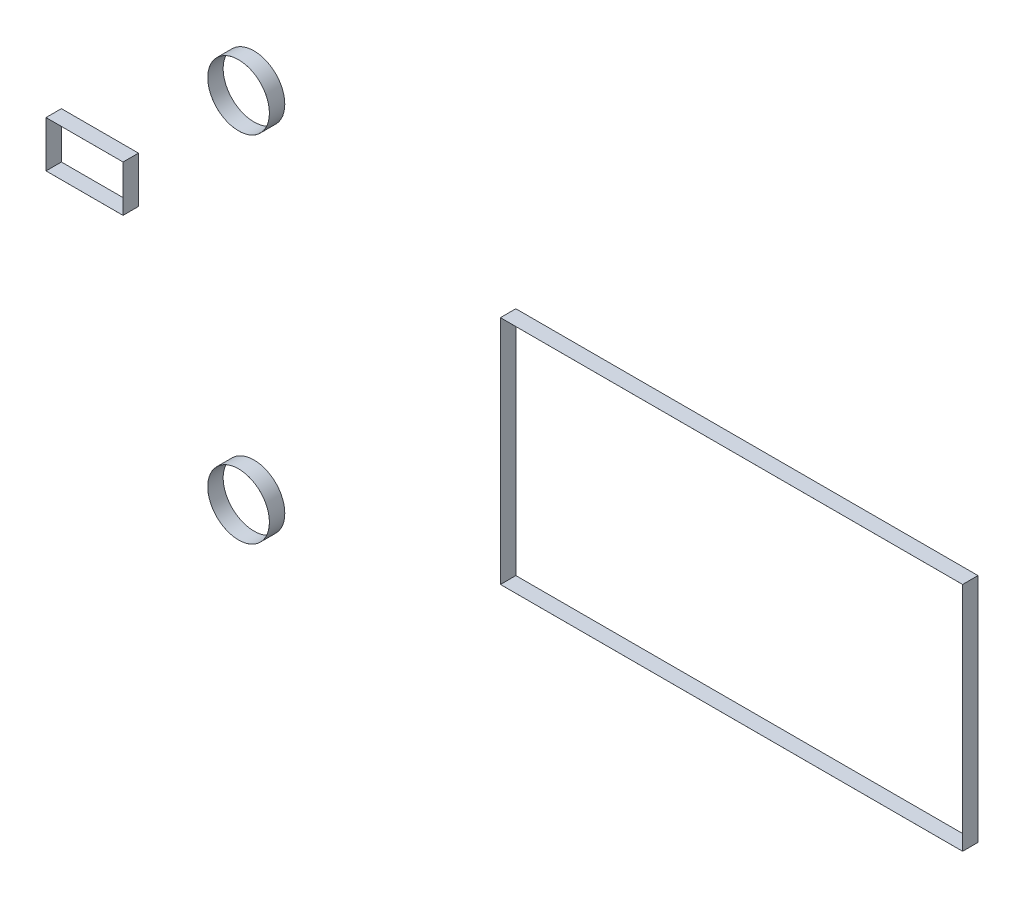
ISO-10303-21;
HEADER;
FILE_DESCRIPTION(('STEP AP214'),'2;1');
FILE_NAME('part.step','',(''),(''),'','','');
FILE_SCHEMA(('AUTOMOTIVE_DESIGN { 1 0 10303 214 1 1 1 1 }'));
ENDSEC;
DATA;
#1=APPLICATION_CONTEXT('core data for automotive mechanical design processes');
#2=APPLICATION_PROTOCOL_DEFINITION('international standard','automotive_design',2000,#1);
#3=PRODUCT_CONTEXT('',#1,'mechanical');
#4=PRODUCT('Part','Part','',(#3));
#5=PRODUCT_RELATED_PRODUCT_CATEGORY('part','',(#4));
#6=PRODUCT_DEFINITION_FORMATION('','',#4);
#7=PRODUCT_DEFINITION_CONTEXT('part definition',#1,'design');
#8=PRODUCT_DEFINITION('design','',#6,#7);
#9=PRODUCT_DEFINITION_SHAPE('','',#8);
#10=(LENGTH_UNIT() NAMED_UNIT(*) SI_UNIT(.MILLI.,.METRE.));
#11=(NAMED_UNIT(*) PLANE_ANGLE_UNIT() SI_UNIT($,.RADIAN.));
#12=(NAMED_UNIT(*) SI_UNIT($,.STERADIAN.) SOLID_ANGLE_UNIT());
#13=UNCERTAINTY_MEASURE_WITH_UNIT(LENGTH_MEASURE(1.E-05),#10,'distance_accuracy_value','');
#14=(GEOMETRIC_REPRESENTATION_CONTEXT(3) GLOBAL_UNCERTAINTY_ASSIGNED_CONTEXT((#13)) GLOBAL_UNIT_ASSIGNED_CONTEXT((#10,
#11,#12)) REPRESENTATION_CONTEXT('',''));
#15=CARTESIAN_POINT('',(0.,0.,0.));
#16=DIRECTION('',(0.,0.,1.));
#17=DIRECTION('',(1.,0.,0.));
#18=AXIS2_PLACEMENT_3D('',#15,#16,#17);
#19=CARTESIAN_POINT('',(-17.,-4.,1.));
#20=DIRECTION('',(0.,0.,1.));
#21=DIRECTION('',(1.,0.,0.));
#22=AXIS2_PLACEMENT_3D('',#19,#20,#21);
#23=PLANE('',#22);
#24=CARTESIAN_POINT('',(-17.,-4.,1.));
#25=DIRECTION('',(0.,0.,1.));
#26=DIRECTION('',(1.,0.,0.));
#27=AXIS2_PLACEMENT_3D('',#24,#25,#26);
#28=CIRCLE('',#27,2.001);
#29=CARTESIAN_POINT('',(-14.999,-4.,1.));
#30=VERTEX_POINT('',#29);
#31=EDGE_CURVE('E12',#30,#30,#28,.T.);
#32=ORIENTED_EDGE('',*,*,#31,.T.);
#33=EDGE_LOOP('',(#32));
#34=FACE_BOUND('',#33,.T.);
#35=CARTESIAN_POINT('',(-17.,-4.,1.));
#36=DIRECTION('',(0.,0.,1.));
#37=DIRECTION('',(1.,0.,0.));
#38=AXIS2_PLACEMENT_3D('',#35,#36,#37);
#39=CIRCLE('',#38,2.);
#40=CARTESIAN_POINT('',(-15.,-4.,1.));
#41=VERTEX_POINT('',#40);
#42=EDGE_CURVE('E117',#41,#41,#39,.T.);
#43=ORIENTED_EDGE('',*,*,#42,.F.);
#44=EDGE_LOOP('',(#43));
#45=FACE_BOUND('',#44,.T.);
#46=ADVANCED_FACE('F106',(#34,#45),#23,.T.);
#47=CARTESIAN_POINT('',(-17.,-4.,0.));
#48=DIRECTION('',(0.,0.,1.));
#49=DIRECTION('',(1.,0.,0.));
#50=AXIS2_PLACEMENT_3D('',#47,#48,#49);
#51=PLANE('',#50);
#52=CARTESIAN_POINT('',(-17.,-4.,0.));
#53=DIRECTION('',(0.,0.,1.));
#54=DIRECTION('',(1.,0.,0.));
#55=AXIS2_PLACEMENT_3D('',#52,#53,#54);
#56=CIRCLE('',#55,2.001);
#57=CARTESIAN_POINT('',(-14.999,-4.,0.));
#58=VERTEX_POINT('',#57);
#59=EDGE_CURVE('E110',#58,#58,#56,.T.);
#60=ORIENTED_EDGE('',*,*,#59,.F.);
#61=EDGE_LOOP('',(#60));
#62=FACE_BOUND('',#61,.T.);
#63=CARTESIAN_POINT('',(-17.,-4.,0.));
#64=DIRECTION('',(0.,0.,1.));
#65=DIRECTION('',(1.,0.,0.));
#66=AXIS2_PLACEMENT_3D('',#63,#64,#65);
#67=CIRCLE('',#66,2.);
#68=CARTESIAN_POINT('',(-15.,-4.,0.));
#69=VERTEX_POINT('',#68);
#70=EDGE_CURVE('E119',#69,#69,#67,.T.);
#71=ORIENTED_EDGE('',*,*,#70,.T.);
#72=EDGE_LOOP('',(#71));
#73=FACE_BOUND('',#72,.T.);
#74=ADVANCED_FACE('F129',(#62,#73),#51,.F.);
#75=CARTESIAN_POINT('',(-17.,-4.,1.));
#76=DIRECTION('',(0.,0.,-1.));
#77=DIRECTION('',(-1.,0.,0.));
#78=AXIS2_PLACEMENT_3D('',#75,#76,#77);
#79=CYLINDRICAL_SURFACE('',#78,2.001);
#80=ORIENTED_EDGE('',*,*,#31,.F.);
#81=EDGE_LOOP('',(#80));
#82=FACE_BOUND('',#81,.T.);
#83=ORIENTED_EDGE('',*,*,#59,.T.);
#84=EDGE_LOOP('',(#83));
#85=FACE_BOUND('',#84,.T.);
#86=ADVANCED_FACE('F108',(#82,#85),#79,.T.);
#87=CARTESIAN_POINT('',(-17.,-4.,1.));
#88=DIRECTION('',(0.,0.,-1.));
#89=DIRECTION('',(-1.,0.,0.));
#90=AXIS2_PLACEMENT_3D('',#87,#88,#89);
#91=CYLINDRICAL_SURFACE('',#90,2.);
#92=ORIENTED_EDGE('',*,*,#42,.T.);
#93=EDGE_LOOP('',(#92));
#94=FACE_BOUND('',#93,.T.);
#95=ORIENTED_EDGE('',*,*,#70,.F.);
#96=EDGE_LOOP('',(#95));
#97=FACE_BOUND('',#96,.T.);
#98=ADVANCED_FACE('F125',(#94,#97),#91,.F.);
#99=CLOSED_SHELL('',(#46,#74,#86,#98));
#100=MANIFOLD_SOLID_BREP('B2',#99);
#101=CARTESIAN_POINT('',(-17.,19.,1.));
#102=DIRECTION('',(0.,0.,1.));
#103=DIRECTION('',(1.,0.,0.));
#104=AXIS2_PLACEMENT_3D('',#101,#102,#103);
#105=PLANE('',#104);
#106=CARTESIAN_POINT('',(-17.,19.,1.));
#107=DIRECTION('',(0.,0.,1.));
#108=DIRECTION('',(1.,0.,0.));
#109=AXIS2_PLACEMENT_3D('',#106,#107,#108);
#110=CIRCLE('',#109,2.001);
#111=CARTESIAN_POINT('',(-14.999,19.,1.));
#112=VERTEX_POINT('',#111);
#113=EDGE_CURVE('E105',#112,#112,#110,.T.);
#114=ORIENTED_EDGE('',*,*,#113,.T.);
#115=EDGE_LOOP('',(#114));
#116=FACE_BOUND('',#115,.T.);
#117=CARTESIAN_POINT('',(-17.,19.,1.));
#118=DIRECTION('',(0.,0.,1.));
#119=DIRECTION('',(1.,0.,0.));
#120=AXIS2_PLACEMENT_3D('',#117,#118,#119);
#121=CIRCLE('',#120,2.);
#122=CARTESIAN_POINT('',(-15.,19.,1.));
#123=VERTEX_POINT('',#122);
#124=EDGE_CURVE('E205',#123,#123,#121,.T.);
#125=ORIENTED_EDGE('',*,*,#124,.F.);
#126=EDGE_LOOP('',(#125));
#127=FACE_BOUND('',#126,.T.);
#128=ADVANCED_FACE('F194',(#116,#127),#105,.T.);
#129=CARTESIAN_POINT('',(-17.,19.,0.));
#130=DIRECTION('',(0.,0.,1.));
#131=DIRECTION('',(1.,0.,0.));
#132=AXIS2_PLACEMENT_3D('',#129,#130,#131);
#133=PLANE('',#132);
#134=CARTESIAN_POINT('',(-17.,19.,0.));
#135=DIRECTION('',(0.,0.,1.));
#136=DIRECTION('',(1.,0.,0.));
#137=AXIS2_PLACEMENT_3D('',#134,#135,#136);
#138=CIRCLE('',#137,2.001);
#139=CARTESIAN_POINT('',(-14.999,19.,0.));
#140=VERTEX_POINT('',#139);
#141=EDGE_CURVE('E198',#140,#140,#138,.T.);
#142=ORIENTED_EDGE('',*,*,#141,.F.);
#143=EDGE_LOOP('',(#142));
#144=FACE_BOUND('',#143,.T.);
#145=CARTESIAN_POINT('',(-17.,19.,0.));
#146=DIRECTION('',(0.,0.,1.));
#147=DIRECTION('',(1.,0.,0.));
#148=AXIS2_PLACEMENT_3D('',#145,#146,#147);
#149=CIRCLE('',#148,2.);
#150=CARTESIAN_POINT('',(-15.,19.,0.));
#151=VERTEX_POINT('',#150);
#152=EDGE_CURVE('E207',#151,#151,#149,.T.);
#153=ORIENTED_EDGE('',*,*,#152,.T.);
#154=EDGE_LOOP('',(#153));
#155=FACE_BOUND('',#154,.T.);
#156=ADVANCED_FACE('F217',(#144,#155),#133,.F.);
#157=CARTESIAN_POINT('',(-17.,19.,1.));
#158=DIRECTION('',(0.,0.,-1.));
#159=DIRECTION('',(-1.,0.,0.));
#160=AXIS2_PLACEMENT_3D('',#157,#158,#159);
#161=CYLINDRICAL_SURFACE('',#160,2.001);
#162=ORIENTED_EDGE('',*,*,#113,.F.);
#163=EDGE_LOOP('',(#162));
#164=FACE_BOUND('',#163,.T.);
#165=ORIENTED_EDGE('',*,*,#141,.T.);
#166=EDGE_LOOP('',(#165));
#167=FACE_BOUND('',#166,.T.);
#168=ADVANCED_FACE('F196',(#164,#167),#161,.T.);
#169=CARTESIAN_POINT('',(-17.,19.,1.));
#170=DIRECTION('',(0.,0.,-1.));
#171=DIRECTION('',(-1.,0.,0.));
#172=AXIS2_PLACEMENT_3D('',#169,#170,#171);
#173=CYLINDRICAL_SURFACE('',#172,2.);
#174=ORIENTED_EDGE('',*,*,#124,.T.);
#175=EDGE_LOOP('',(#174));
#176=FACE_BOUND('',#175,.T.);
#177=ORIENTED_EDGE('',*,*,#152,.F.);
#178=EDGE_LOOP('',(#177));
#179=FACE_BOUND('',#178,.T.);
#180=ADVANCED_FACE('F213',(#176,#179),#173,.F.);
#181=CLOSED_SHELL('',(#128,#156,#168,#180));
#182=MANIFOLD_SOLID_BREP('B7',#181);
#183=CARTESIAN_POINT('',(0.,0.,1.));
#184=DIRECTION('',(0.,0.,1.));
#185=DIRECTION('',(1.,0.,0.));
#186=AXIS2_PLACEMENT_3D('',#183,#184,#185);
#187=PLANE('',#186);
#188=DIRECTION('',(0.,-1.,0.));
#189=VECTOR('',#188,1.);
#190=CARTESIAN_POINT('',(-29.501,11.5,1.));
#191=LINE('',#190,#189);
#192=CARTESIAN_POINT('',(-29.501,11.501,1.));
#193=VERTEX_POINT('',#192);
#194=CARTESIAN_POINT('',(-29.501,8.499,1.));
#195=VERTEX_POINT('',#194);
#196=EDGE_CURVE('E382',#193,#195,#191,.T.);
#197=ORIENTED_EDGE('',*,*,#196,.T.);
#198=DIRECTION('',(1.,0.,0.));
#199=VECTOR('',#198,1.);
#200=CARTESIAN_POINT('',(-29.5,8.499,1.));
#201=LINE('',#200,#199);
#202=CARTESIAN_POINT('',(-24.499,8.499,1.));
#203=VERTEX_POINT('',#202);
#204=EDGE_CURVE('E385',#195,#203,#201,.T.);
#205=ORIENTED_EDGE('',*,*,#204,.T.);
#206=DIRECTION('',(0.,1.,0.));
#207=VECTOR('',#206,1.);
#208=CARTESIAN_POINT('',(-24.499,11.5,1.));
#209=LINE('',#208,#207);
#210=CARTESIAN_POINT('',(-24.499,11.501,1.));
#211=VERTEX_POINT('',#210);
#212=EDGE_CURVE('E388',#203,#211,#209,.T.);
#213=ORIENTED_EDGE('',*,*,#212,.T.);
#214=DIRECTION('',(-1.,0.,0.));
#215=VECTOR('',#214,1.);
#216=CARTESIAN_POINT('',(-29.5,11.501,1.));
#217=LINE('',#216,#215);
#218=EDGE_CURVE('E390',#211,#193,#217,.T.);
#219=ORIENTED_EDGE('',*,*,#218,.T.);
#220=EDGE_LOOP('',(#197,#205,#213,#219));
#221=FACE_BOUND('',#220,.T.);
#222=DIRECTION('',(1.,0.,0.));
#223=VECTOR('',#222,1.);
#224=CARTESIAN_POINT('',(-29.5,8.5,1.));
#225=LINE('',#224,#223);
#226=CARTESIAN_POINT('',(-29.5,8.5,1.));
#227=VERTEX_POINT('',#226);
#228=CARTESIAN_POINT('',(-24.5,8.5,1.));
#229=VERTEX_POINT('',#228);
#230=EDGE_CURVE('E354',#227,#229,#225,.T.);
#231=ORIENTED_EDGE('',*,*,#230,.F.);
#232=DIRECTION('',(0.,-1.,0.));
#233=VECTOR('',#232,1.);
#234=CARTESIAN_POINT('',(-29.5,11.5,1.));
#235=LINE('',#234,#233);
#236=CARTESIAN_POINT('',(-29.5,11.5,1.));
#237=VERTEX_POINT('',#236);
#238=EDGE_CURVE('E346',#237,#227,#235,.T.);
#239=ORIENTED_EDGE('',*,*,#238,.F.);
#240=DIRECTION('',(-1.,0.,0.));
#241=VECTOR('',#240,1.);
#242=CARTESIAN_POINT('',(-29.5,11.5,1.));
#243=LINE('',#242,#241);
#244=CARTESIAN_POINT('',(-24.5,11.5,1.));
#245=VERTEX_POINT('',#244);
#246=EDGE_CURVE('E368',#245,#237,#243,.T.);
#247=ORIENTED_EDGE('',*,*,#246,.F.);
#248=DIRECTION('',(0.,1.,0.));
#249=VECTOR('',#248,1.);
#250=CARTESIAN_POINT('',(-24.5,11.5,1.));
#251=LINE('',#250,#249);
#252=EDGE_CURVE('E366',#229,#245,#251,.T.);
#253=ORIENTED_EDGE('',*,*,#252,.F.);
#254=EDGE_LOOP('',(#231,#239,#247,#253));
#255=FACE_BOUND('',#254,.T.);
#256=ADVANCED_FACE('F281',(#221,#255),#187,.T.);
#257=CARTESIAN_POINT('',(0.,0.,0.));
#258=DIRECTION('',(0.,0.,1.));
#259=DIRECTION('',(1.,0.,0.));
#260=AXIS2_PLACEMENT_3D('',#257,#258,#259);
#261=PLANE('',#260);
#262=DIRECTION('',(0.,-1.,0.));
#263=VECTOR('',#262,1.);
#264=CARTESIAN_POINT('',(-29.501,11.5,0.));
#265=LINE('',#264,#263);
#266=CARTESIAN_POINT('',(-29.501,11.501,0.));
#267=VERTEX_POINT('',#266);
#268=CARTESIAN_POINT('',(-29.501,8.499,0.));
#269=VERTEX_POINT('',#268);
#270=EDGE_CURVE('E362',#267,#269,#265,.T.);
#271=ORIENTED_EDGE('',*,*,#270,.F.);
#272=DIRECTION('',(-1.,0.,0.));
#273=VECTOR('',#272,1.);
#274=CARTESIAN_POINT('',(-29.5,11.501,0.));
#275=LINE('',#274,#273);
#276=CARTESIAN_POINT('',(-24.499,11.501,0.));
#277=VERTEX_POINT('',#276);
#278=EDGE_CURVE('E386',#277,#267,#275,.T.);
#279=ORIENTED_EDGE('',*,*,#278,.F.);
#280=DIRECTION('',(0.,1.,0.));
#281=VECTOR('',#280,1.);
#282=CARTESIAN_POINT('',(-24.499,11.5,0.));
#283=LINE('',#282,#281);
#284=CARTESIAN_POINT('',(-24.499,8.499,0.));
#285=VERTEX_POINT('',#284);
#286=EDGE_CURVE('E397',#285,#277,#283,.T.);
#287=ORIENTED_EDGE('',*,*,#286,.F.);
#288=DIRECTION('',(1.,0.,0.));
#289=VECTOR('',#288,1.);
#290=CARTESIAN_POINT('',(-29.5,8.499,0.));
#291=LINE('',#290,#289);
#292=EDGE_CURVE('E395',#269,#285,#291,.T.);
#293=ORIENTED_EDGE('',*,*,#292,.F.);
#294=EDGE_LOOP('',(#271,#279,#287,#293));
#295=FACE_BOUND('',#294,.T.);
#296=DIRECTION('',(0.,-1.,0.));
#297=VECTOR('',#296,1.);
#298=CARTESIAN_POINT('',(-29.5,11.5,0.));
#299=LINE('',#298,#297);
#300=CARTESIAN_POINT('',(-29.5,11.5,0.));
#301=VERTEX_POINT('',#300);
#302=CARTESIAN_POINT('',(-29.5,8.5,0.));
#303=VERTEX_POINT('',#302);
#304=EDGE_CURVE('E304',#301,#303,#299,.T.);
#305=ORIENTED_EDGE('',*,*,#304,.T.);
#306=DIRECTION('',(1.,0.,0.));
#307=VECTOR('',#306,1.);
#308=CARTESIAN_POINT('',(-29.5,8.5,0.));
#309=LINE('',#308,#307);
#310=CARTESIAN_POINT('',(-24.5,8.5,0.));
#311=VERTEX_POINT('',#310);
#312=EDGE_CURVE('E361',#303,#311,#309,.T.);
#313=ORIENTED_EDGE('',*,*,#312,.T.);
#314=DIRECTION('',(0.,1.,0.));
#315=VECTOR('',#314,1.);
#316=CARTESIAN_POINT('',(-24.5,11.5,0.));
#317=LINE('',#316,#315);
#318=CARTESIAN_POINT('',(-24.5,11.5,0.));
#319=VERTEX_POINT('',#318);
#320=EDGE_CURVE('E374',#311,#319,#317,.T.);
#321=ORIENTED_EDGE('',*,*,#320,.T.);
#322=DIRECTION('',(-1.,0.,0.));
#323=VECTOR('',#322,1.);
#324=CARTESIAN_POINT('',(-29.5,11.5,0.));
#325=LINE('',#324,#323);
#326=EDGE_CURVE('E355',#319,#301,#325,.T.);
#327=ORIENTED_EDGE('',*,*,#326,.T.);
#328=EDGE_LOOP('',(#305,#313,#321,#327));
#329=FACE_BOUND('',#328,.T.);
#330=ADVANCED_FACE('F415',(#295,#329),#261,.F.);
#331=CARTESIAN_POINT('',(-29.501,11.5,1.));
#332=DIRECTION('',(1.,0.,0.));
#333=DIRECTION('',(0.,0.,-1.));
#334=AXIS2_PLACEMENT_3D('',#331,#332,#333);
#335=PLANE('',#334);
#336=ORIENTED_EDGE('',*,*,#270,.T.);
#337=DIRECTION('',(0.,0.,-1.));
#338=VECTOR('',#337,1.);
#339=CARTESIAN_POINT('',(-29.501,8.499,1.));
#340=LINE('',#339,#338);
#341=EDGE_CURVE('E192',#195,#269,#340,.T.);
#342=ORIENTED_EDGE('',*,*,#341,.F.);
#343=ORIENTED_EDGE('',*,*,#196,.F.);
#344=DIRECTION('',(0.,0.,-1.));
#345=VECTOR('',#344,1.);
#346=CARTESIAN_POINT('',(-29.501,11.501,1.));
#347=LINE('',#346,#345);
#348=EDGE_CURVE('E392',#193,#267,#347,.T.);
#349=ORIENTED_EDGE('',*,*,#348,.T.);
#350=EDGE_LOOP('',(#336,#342,#343,#349));
#351=FACE_BOUND('',#350,.T.);
#352=ADVANCED_FACE('F283',(#351),#335,.F.);
#353=CARTESIAN_POINT('',(-29.5,8.499,1.));
#354=DIRECTION('',(0.,1.,0.));
#355=DIRECTION('',(0.,0.,1.));
#356=AXIS2_PLACEMENT_3D('',#353,#354,#355);
#357=PLANE('',#356);
#358=ORIENTED_EDGE('',*,*,#292,.T.);
#359=DIRECTION('',(0.,0.,-1.));
#360=VECTOR('',#359,1.);
#361=CARTESIAN_POINT('',(-24.499,8.499,1.));
#362=LINE('',#361,#360);
#363=EDGE_CURVE('E289',#203,#285,#362,.T.);
#364=ORIENTED_EDGE('',*,*,#363,.F.);
#365=ORIENTED_EDGE('',*,*,#204,.F.);
#366=ORIENTED_EDGE('',*,*,#341,.T.);
#367=EDGE_LOOP('',(#358,#364,#365,#366));
#368=FACE_BOUND('',#367,.T.);
#369=ADVANCED_FACE('F425',(#368),#357,.F.);
#370=CARTESIAN_POINT('',(-24.499,11.5,1.));
#371=DIRECTION('',(-1.,0.,0.));
#372=DIRECTION('',(0.,0.,1.));
#373=AXIS2_PLACEMENT_3D('',#370,#371,#372);
#374=PLANE('',#373);
#375=ORIENTED_EDGE('',*,*,#286,.T.);
#376=DIRECTION('',(0.,0.,-1.));
#377=VECTOR('',#376,1.);
#378=CARTESIAN_POINT('',(-24.499,11.501,1.));
#379=LINE('',#378,#377);
#380=EDGE_CURVE('E402',#211,#277,#379,.T.);
#381=ORIENTED_EDGE('',*,*,#380,.F.);
#382=ORIENTED_EDGE('',*,*,#212,.F.);
#383=ORIENTED_EDGE('',*,*,#363,.T.);
#384=EDGE_LOOP('',(#375,#381,#382,#383));
#385=FACE_BOUND('',#384,.T.);
#386=ADVANCED_FACE('F409',(#385),#374,.F.);
#387=CARTESIAN_POINT('',(-29.5,11.501,1.));
#388=DIRECTION('',(0.,-1.,0.));
#389=DIRECTION('',(0.,0.,-1.));
#390=AXIS2_PLACEMENT_3D('',#387,#388,#389);
#391=PLANE('',#390);
#392=ORIENTED_EDGE('',*,*,#278,.T.);
#393=ORIENTED_EDGE('',*,*,#348,.F.);
#394=ORIENTED_EDGE('',*,*,#218,.F.);
#395=ORIENTED_EDGE('',*,*,#380,.T.);
#396=EDGE_LOOP('',(#392,#393,#394,#395));
#397=FACE_BOUND('',#396,.T.);
#398=ADVANCED_FACE('F419',(#397),#391,.F.);
#399=CARTESIAN_POINT('',(-29.5,11.5,1.));
#400=DIRECTION('',(1.,0.,0.));
#401=DIRECTION('',(0.,0.,-1.));
#402=AXIS2_PLACEMENT_3D('',#399,#400,#401);
#403=PLANE('',#402);
#404=ORIENTED_EDGE('',*,*,#304,.F.);
#405=DIRECTION('',(0.,0.,-1.));
#406=VECTOR('',#405,1.);
#407=CARTESIAN_POINT('',(-29.5,11.5,1.));
#408=LINE('',#407,#406);
#409=EDGE_CURVE('E350',#237,#301,#408,.T.);
#410=ORIENTED_EDGE('',*,*,#409,.F.);
#411=ORIENTED_EDGE('',*,*,#238,.T.);
#412=DIRECTION('',(0.,0.,-1.));
#413=VECTOR('',#412,1.);
#414=CARTESIAN_POINT('',(-29.5,8.5,1.));
#415=LINE('',#414,#413);
#416=EDGE_CURVE('E349',#227,#303,#415,.T.);
#417=ORIENTED_EDGE('',*,*,#416,.T.);
#418=EDGE_LOOP('',(#404,#410,#411,#417));
#419=FACE_BOUND('',#418,.T.);
#420=ADVANCED_FACE('F348',(#419),#403,.T.);
#421=CARTESIAN_POINT('',(-29.5,8.5,1.));
#422=DIRECTION('',(0.,1.,0.));
#423=DIRECTION('',(0.,0.,1.));
#424=AXIS2_PLACEMENT_3D('',#421,#422,#423);
#425=PLANE('',#424);
#426=ORIENTED_EDGE('',*,*,#312,.F.);
#427=ORIENTED_EDGE('',*,*,#416,.F.);
#428=ORIENTED_EDGE('',*,*,#230,.T.);
#429=DIRECTION('',(0.,0.,-1.));
#430=VECTOR('',#429,1.);
#431=CARTESIAN_POINT('',(-24.5,8.5,1.));
#432=LINE('',#431,#430);
#433=EDGE_CURVE('E363',#229,#311,#432,.T.);
#434=ORIENTED_EDGE('',*,*,#433,.T.);
#435=EDGE_LOOP('',(#426,#427,#428,#434));
#436=FACE_BOUND('',#435,.T.);
#437=ADVANCED_FACE('F358',(#436),#425,.T.);
#438=CARTESIAN_POINT('',(-24.5,11.5,1.));
#439=DIRECTION('',(-1.,0.,0.));
#440=DIRECTION('',(0.,0.,1.));
#441=AXIS2_PLACEMENT_3D('',#438,#439,#440);
#442=PLANE('',#441);
#443=ORIENTED_EDGE('',*,*,#320,.F.);
#444=ORIENTED_EDGE('',*,*,#433,.F.);
#445=ORIENTED_EDGE('',*,*,#252,.T.);
#446=DIRECTION('',(0.,0.,-1.));
#447=VECTOR('',#446,1.);
#448=CARTESIAN_POINT('',(-24.5,11.5,1.));
#449=LINE('',#448,#447);
#450=EDGE_CURVE('E296',#245,#319,#449,.T.);
#451=ORIENTED_EDGE('',*,*,#450,.T.);
#452=EDGE_LOOP('',(#443,#444,#445,#451));
#453=FACE_BOUND('',#452,.T.);
#454=ADVANCED_FACE('F448',(#453),#442,.T.);
#455=CARTESIAN_POINT('',(-29.5,11.5,1.));
#456=DIRECTION('',(0.,-1.,0.));
#457=DIRECTION('',(0.,0.,-1.));
#458=AXIS2_PLACEMENT_3D('',#455,#456,#457);
#459=PLANE('',#458);
#460=ORIENTED_EDGE('',*,*,#326,.F.);
#461=ORIENTED_EDGE('',*,*,#450,.F.);
#462=ORIENTED_EDGE('',*,*,#246,.T.);
#463=ORIENTED_EDGE('',*,*,#409,.T.);
#464=EDGE_LOOP('',(#460,#461,#462,#463));
#465=FACE_BOUND('',#464,.T.);
#466=ADVANCED_FACE('F452',(#465),#459,.T.);
#467=CLOSED_SHELL('',(#256,#330,#352,#369,#386,#398,#420,#437,#454,#466));
#468=MANIFOLD_SOLID_BREP('B100',#467);
#469=CARTESIAN_POINT('',(0.,0.,1.));
#470=DIRECTION('',(0.,0.,1.));
#471=DIRECTION('',(1.,0.,0.));
#472=AXIS2_PLACEMENT_3D('',#469,#470,#471);
#473=PLANE('',#472);
#474=DIRECTION('',(0.,-1.,0.));
#475=VECTOR('',#474,1.);
#476=CARTESIAN_POINT('',(-0.001,0.,1.));
#477=LINE('',#476,#475);
#478=CARTESIAN_POINT('',(-0.001,15.001,1.));
#479=VERTEX_POINT('',#478);
#480=CARTESIAN_POINT('',(-0.001,-0.001,1.));
#481=VERTEX_POINT('',#480);
#482=EDGE_CURVE('E652',#479,#481,#477,.T.);
#483=ORIENTED_EDGE('',*,*,#482,.T.);
#484=DIRECTION('',(1.,0.,0.));
#485=VECTOR('',#484,1.);
#486=CARTESIAN_POINT('',(0.,-0.001,1.));
#487=LINE('',#486,#485);
#488=CARTESIAN_POINT('',(30.001,-0.001,1.));
#489=VERTEX_POINT('',#488);
#490=EDGE_CURVE('E655',#481,#489,#487,.T.);
#491=ORIENTED_EDGE('',*,*,#490,.T.);
#492=DIRECTION('',(0.,1.,0.));
#493=VECTOR('',#492,1.);
#494=CARTESIAN_POINT('',(30.001,0.,1.));
#495=LINE('',#494,#493);
#496=CARTESIAN_POINT('',(30.001,15.001,1.));
#497=VERTEX_POINT('',#496);
#498=EDGE_CURVE('E658',#489,#497,#495,.T.);
#499=ORIENTED_EDGE('',*,*,#498,.T.);
#500=DIRECTION('',(-1.,0.,0.));
#501=VECTOR('',#500,1.);
#502=CARTESIAN_POINT('',(0.,15.001,1.));
#503=LINE('',#502,#501);
#504=EDGE_CURVE('E660',#497,#479,#503,.T.);
#505=ORIENTED_EDGE('',*,*,#504,.T.);
#506=EDGE_LOOP('',(#483,#491,#499,#505));
#507=FACE_BOUND('',#506,.T.);
#508=DIRECTION('',(1.,0.,0.));
#509=VECTOR('',#508,1.);
#510=CARTESIAN_POINT('',(0.,0.,1.));
#511=LINE('',#510,#509);
#512=CARTESIAN_POINT('',(0.,0.,1.));
#513=VERTEX_POINT('',#512);
#514=CARTESIAN_POINT('',(30.,0.,1.));
#515=VERTEX_POINT('',#514);
#516=EDGE_CURVE('E624',#513,#515,#511,.T.);
#517=ORIENTED_EDGE('',*,*,#516,.F.);
#518=DIRECTION('',(0.,-1.,0.));
#519=VECTOR('',#518,1.);
#520=CARTESIAN_POINT('',(0.,0.,1.));
#521=LINE('',#520,#519);
#522=CARTESIAN_POINT('',(0.,15.,1.));
#523=VERTEX_POINT('',#522);
#524=EDGE_CURVE('E616',#523,#513,#521,.T.);
#525=ORIENTED_EDGE('',*,*,#524,.F.);
#526=DIRECTION('',(-1.,0.,0.));
#527=VECTOR('',#526,1.);
#528=CARTESIAN_POINT('',(0.,15.,1.));
#529=LINE('',#528,#527);
#530=CARTESIAN_POINT('',(30.,15.,1.));
#531=VERTEX_POINT('',#530);
#532=EDGE_CURVE('E638',#531,#523,#529,.T.);
#533=ORIENTED_EDGE('',*,*,#532,.F.);
#534=DIRECTION('',(0.,1.,0.));
#535=VECTOR('',#534,1.);
#536=CARTESIAN_POINT('',(30.,0.,1.));
#537=LINE('',#536,#535);
#538=EDGE_CURVE('E636',#515,#531,#537,.T.);
#539=ORIENTED_EDGE('',*,*,#538,.F.);
#540=EDGE_LOOP('',(#517,#525,#533,#539));
#541=FACE_BOUND('',#540,.T.);
#542=ADVANCED_FACE('F551',(#507,#541),#473,.T.);
#543=CARTESIAN_POINT('',(0.,0.,0.));
#544=DIRECTION('',(0.,0.,1.));
#545=DIRECTION('',(1.,0.,0.));
#546=AXIS2_PLACEMENT_3D('',#543,#544,#545);
#547=PLANE('',#546);
#548=DIRECTION('',(0.,-1.,0.));
#549=VECTOR('',#548,1.);
#550=CARTESIAN_POINT('',(-0.001,0.,0.));
#551=LINE('',#550,#549);
#552=CARTESIAN_POINT('',(-0.001,15.001,0.));
#553=VERTEX_POINT('',#552);
#554=CARTESIAN_POINT('',(-0.001,-0.001,0.));
#555=VERTEX_POINT('',#554);
#556=EDGE_CURVE('E632',#553,#555,#551,.T.);
#557=ORIENTED_EDGE('',*,*,#556,.F.);
#558=DIRECTION('',(-1.,0.,0.));
#559=VECTOR('',#558,1.);
#560=CARTESIAN_POINT('',(0.,15.001,0.));
#561=LINE('',#560,#559);
#562=CARTESIAN_POINT('',(30.001,15.001,0.));
#563=VERTEX_POINT('',#562);
#564=EDGE_CURVE('E656',#563,#553,#561,.T.);
#565=ORIENTED_EDGE('',*,*,#564,.F.);
#566=DIRECTION('',(0.,1.,0.));
#567=VECTOR('',#566,1.);
#568=CARTESIAN_POINT('',(30.001,0.,0.));
#569=LINE('',#568,#567);
#570=CARTESIAN_POINT('',(30.001,-0.001,0.));
#571=VERTEX_POINT('',#570);
#572=EDGE_CURVE('E667',#571,#563,#569,.T.);
#573=ORIENTED_EDGE('',*,*,#572,.F.);
#574=DIRECTION('',(1.,0.,0.));
#575=VECTOR('',#574,1.);
#576=CARTESIAN_POINT('',(0.,-0.001,0.));
#577=LINE('',#576,#575);
#578=EDGE_CURVE('E665',#555,#571,#577,.T.);
#579=ORIENTED_EDGE('',*,*,#578,.F.);
#580=EDGE_LOOP('',(#557,#565,#573,#579));
#581=FACE_BOUND('',#580,.T.);
#582=DIRECTION('',(0.,-1.,0.));
#583=VECTOR('',#582,1.);
#584=CARTESIAN_POINT('',(0.,0.,0.));
#585=LINE('',#584,#583);
#586=CARTESIAN_POINT('',(0.,15.,0.));
#587=VERTEX_POINT('',#586);
#588=CARTESIAN_POINT('',(0.,0.,0.));
#589=VERTEX_POINT('',#588);
#590=EDGE_CURVE('E574',#587,#589,#585,.T.);
#591=ORIENTED_EDGE('',*,*,#590,.T.);
#592=DIRECTION('',(1.,0.,0.));
#593=VECTOR('',#592,1.);
#594=CARTESIAN_POINT('',(0.,0.,0.));
#595=LINE('',#594,#593);
#596=CARTESIAN_POINT('',(30.,0.,0.));
#597=VERTEX_POINT('',#596);
#598=EDGE_CURVE('E631',#589,#597,#595,.T.);
#599=ORIENTED_EDGE('',*,*,#598,.T.);
#600=DIRECTION('',(0.,1.,0.));
#601=VECTOR('',#600,1.);
#602=CARTESIAN_POINT('',(30.,0.,0.));
#603=LINE('',#602,#601);
#604=CARTESIAN_POINT('',(30.,15.,0.));
#605=VERTEX_POINT('',#604);
#606=EDGE_CURVE('E644',#597,#605,#603,.T.);
#607=ORIENTED_EDGE('',*,*,#606,.T.);
#608=DIRECTION('',(-1.,0.,0.));
#609=VECTOR('',#608,1.);
#610=CARTESIAN_POINT('',(0.,15.,0.));
#611=LINE('',#610,#609);
#612=EDGE_CURVE('E625',#605,#587,#611,.T.);
#613=ORIENTED_EDGE('',*,*,#612,.T.);
#614=EDGE_LOOP('',(#591,#599,#607,#613));
#615=FACE_BOUND('',#614,.T.);
#616=ADVANCED_FACE('F685',(#581,#615),#547,.F.);
#617=CARTESIAN_POINT('',(-0.001,0.,1.));
#618=DIRECTION('',(1.,0.,0.));
#619=DIRECTION('',(0.,0.,-1.));
#620=AXIS2_PLACEMENT_3D('',#617,#618,#619);
#621=PLANE('',#620);
#622=ORIENTED_EDGE('',*,*,#556,.T.);
#623=DIRECTION('',(0.,0.,-1.));
#624=VECTOR('',#623,1.);
#625=CARTESIAN_POINT('',(-0.001,-0.001,1.));
#626=LINE('',#625,#624);
#627=EDGE_CURVE('E279',#481,#555,#626,.T.);
#628=ORIENTED_EDGE('',*,*,#627,.F.);
#629=ORIENTED_EDGE('',*,*,#482,.F.);
#630=DIRECTION('',(0.,0.,-1.));
#631=VECTOR('',#630,1.);
#632=CARTESIAN_POINT('',(-0.001,15.001,1.));
#633=LINE('',#632,#631);
#634=EDGE_CURVE('E662',#479,#553,#633,.T.);
#635=ORIENTED_EDGE('',*,*,#634,.T.);
#636=EDGE_LOOP('',(#622,#628,#629,#635));
#637=FACE_BOUND('',#636,.T.);
#638=ADVANCED_FACE('F553',(#637),#621,.F.);
#639=CARTESIAN_POINT('',(0.,-0.001,1.));
#640=DIRECTION('',(0.,1.,0.));
#641=DIRECTION('',(0.,0.,1.));
#642=AXIS2_PLACEMENT_3D('',#639,#640,#641);
#643=PLANE('',#642);
#644=ORIENTED_EDGE('',*,*,#578,.T.);
#645=DIRECTION('',(0.,0.,-1.));
#646=VECTOR('',#645,1.);
#647=CARTESIAN_POINT('',(30.001,-0.001,1.));
#648=LINE('',#647,#646);
#649=EDGE_CURVE('E559',#489,#571,#648,.T.);
#650=ORIENTED_EDGE('',*,*,#649,.F.);
#651=ORIENTED_EDGE('',*,*,#490,.F.);
#652=ORIENTED_EDGE('',*,*,#627,.T.);
#653=EDGE_LOOP('',(#644,#650,#651,#652));
#654=FACE_BOUND('',#653,.T.);
#655=ADVANCED_FACE('F695',(#654),#643,.F.);
#656=CARTESIAN_POINT('',(30.001,0.,1.));
#657=DIRECTION('',(-1.,0.,0.));
#658=DIRECTION('',(0.,0.,1.));
#659=AXIS2_PLACEMENT_3D('',#656,#657,#658);
#660=PLANE('',#659);
#661=ORIENTED_EDGE('',*,*,#572,.T.);
#662=DIRECTION('',(0.,0.,-1.));
#663=VECTOR('',#662,1.);
#664=CARTESIAN_POINT('',(30.001,15.001,1.));
#665=LINE('',#664,#663);
#666=EDGE_CURVE('E672',#497,#563,#665,.T.);
#667=ORIENTED_EDGE('',*,*,#666,.F.);
#668=ORIENTED_EDGE('',*,*,#498,.F.);
#669=ORIENTED_EDGE('',*,*,#649,.T.);
#670=EDGE_LOOP('',(#661,#667,#668,#669));
#671=FACE_BOUND('',#670,.T.);
#672=ADVANCED_FACE('F679',(#671),#660,.F.);
#673=CARTESIAN_POINT('',(0.,15.001,1.));
#674=DIRECTION('',(0.,-1.,0.));
#675=DIRECTION('',(0.,0.,-1.));
#676=AXIS2_PLACEMENT_3D('',#673,#674,#675);
#677=PLANE('',#676);
#678=ORIENTED_EDGE('',*,*,#564,.T.);
#679=ORIENTED_EDGE('',*,*,#634,.F.);
#680=ORIENTED_EDGE('',*,*,#504,.F.);
#681=ORIENTED_EDGE('',*,*,#666,.T.);
#682=EDGE_LOOP('',(#678,#679,#680,#681));
#683=FACE_BOUND('',#682,.T.);
#684=ADVANCED_FACE('F689',(#683),#677,.F.);
#685=CARTESIAN_POINT('',(0.,0.,1.));
#686=DIRECTION('',(1.,0.,0.));
#687=DIRECTION('',(0.,0.,-1.));
#688=AXIS2_PLACEMENT_3D('',#685,#686,#687);
#689=PLANE('',#688);
#690=ORIENTED_EDGE('',*,*,#590,.F.);
#691=DIRECTION('',(0.,0.,-1.));
#692=VECTOR('',#691,1.);
#693=CARTESIAN_POINT('',(0.,15.,1.));
#694=LINE('',#693,#692);
#695=EDGE_CURVE('E620',#523,#587,#694,.T.);
#696=ORIENTED_EDGE('',*,*,#695,.F.);
#697=ORIENTED_EDGE('',*,*,#524,.T.);
#698=DIRECTION('',(0.,0.,-1.));
#699=VECTOR('',#698,1.);
#700=CARTESIAN_POINT('',(0.,0.,1.));
#701=LINE('',#700,#699);
#702=EDGE_CURVE('E619',#513,#589,#701,.T.);
#703=ORIENTED_EDGE('',*,*,#702,.T.);
#704=EDGE_LOOP('',(#690,#696,#697,#703));
#705=FACE_BOUND('',#704,.T.);
#706=ADVANCED_FACE('F618',(#705),#689,.T.);
#707=CARTESIAN_POINT('',(0.,0.,1.));
#708=DIRECTION('',(0.,1.,0.));
#709=DIRECTION('',(0.,0.,1.));
#710=AXIS2_PLACEMENT_3D('',#707,#708,#709);
#711=PLANE('',#710);
#712=ORIENTED_EDGE('',*,*,#598,.F.);
#713=ORIENTED_EDGE('',*,*,#702,.F.);
#714=ORIENTED_EDGE('',*,*,#516,.T.);
#715=DIRECTION('',(0.,0.,-1.));
#716=VECTOR('',#715,1.);
#717=CARTESIAN_POINT('',(30.,0.,1.));
#718=LINE('',#717,#716);
#719=EDGE_CURVE('E633',#515,#597,#718,.T.);
#720=ORIENTED_EDGE('',*,*,#719,.T.);
#721=EDGE_LOOP('',(#712,#713,#714,#720));
#722=FACE_BOUND('',#721,.T.);
#723=ADVANCED_FACE('F628',(#722),#711,.T.);
#724=CARTESIAN_POINT('',(30.,0.,1.));
#725=DIRECTION('',(-1.,0.,0.));
#726=DIRECTION('',(0.,0.,1.));
#727=AXIS2_PLACEMENT_3D('',#724,#725,#726);
#728=PLANE('',#727);
#729=ORIENTED_EDGE('',*,*,#606,.F.);
#730=ORIENTED_EDGE('',*,*,#719,.F.);
#731=ORIENTED_EDGE('',*,*,#538,.T.);
#732=DIRECTION('',(0.,0.,-1.));
#733=VECTOR('',#732,1.);
#734=CARTESIAN_POINT('',(30.,15.,1.));
#735=LINE('',#734,#733);
#736=EDGE_CURVE('E566',#531,#605,#735,.T.);
#737=ORIENTED_EDGE('',*,*,#736,.T.);
#738=EDGE_LOOP('',(#729,#730,#731,#737));
#739=FACE_BOUND('',#738,.T.);
#740=ADVANCED_FACE('F718',(#739),#728,.T.);
#741=CARTESIAN_POINT('',(0.,15.,1.));
#742=DIRECTION('',(0.,-1.,0.));
#743=DIRECTION('',(0.,0.,-1.));
#744=AXIS2_PLACEMENT_3D('',#741,#742,#743);
#745=PLANE('',#744);
#746=ORIENTED_EDGE('',*,*,#612,.F.);
#747=ORIENTED_EDGE('',*,*,#736,.F.);
#748=ORIENTED_EDGE('',*,*,#532,.T.);
#749=ORIENTED_EDGE('',*,*,#695,.T.);
#750=EDGE_LOOP('',(#746,#747,#748,#749));
#751=FACE_BOUND('',#750,.T.);
#752=ADVANCED_FACE('F722',(#751),#745,.T.);
#753=CLOSED_SHELL('',(#542,#616,#638,#655,#672,#684,#706,#723,#740,#752));
#754=MANIFOLD_SOLID_BREP('B186',#753);
#755=ADVANCED_BREP_SHAPE_REPRESENTATION('',(#18,#100,#182,#468,#754),#14);
#756=SHAPE_DEFINITION_REPRESENTATION(#9,#755);
ENDSEC;
END-ISO-10303-21;
